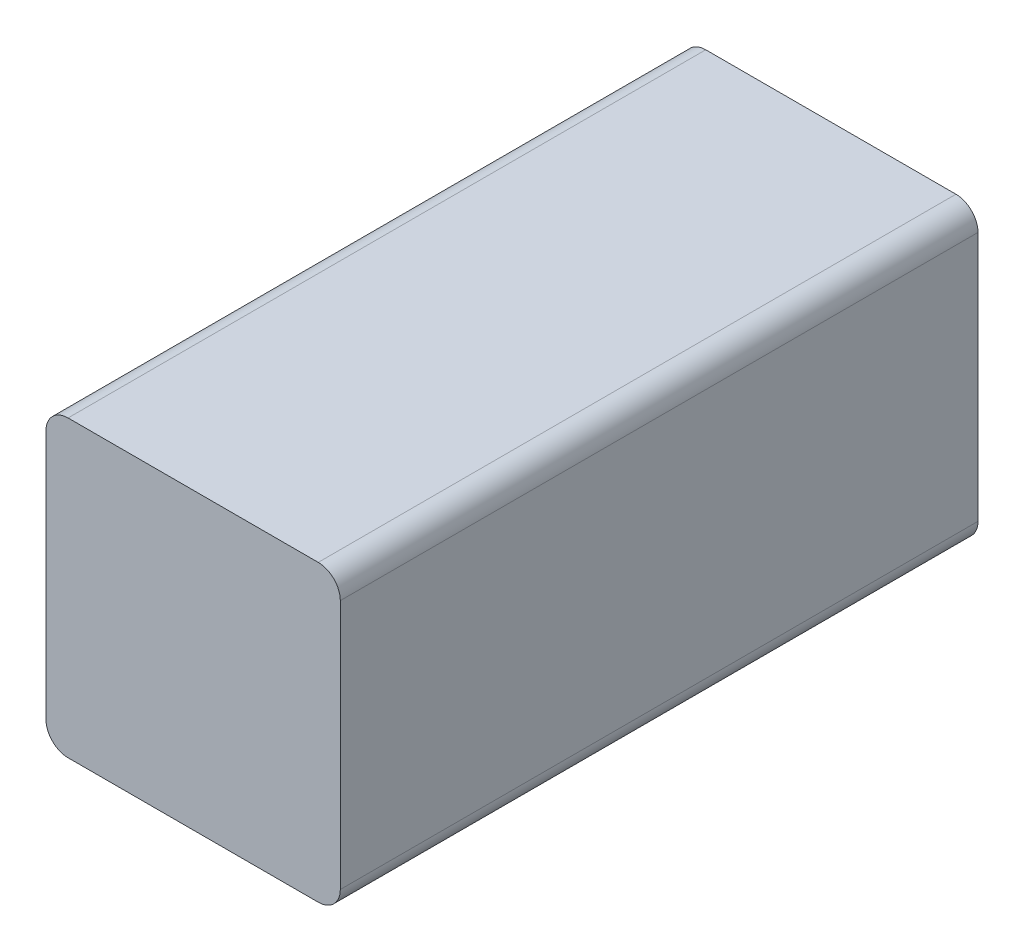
from build123d import *

# Parameters (mm, degrees)
EXTRUSION1_DEPTH = 65


with BuildPart() as part:
    # Esquisse1 → Extrusion1 (new body)
    with BuildSketch(Plane.XY):
        with BuildLine():
            Line((-15, 12.75), (-15, -12.75))
            ThreePointArc((-15, -12.75), (-14.340990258, -14.340990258), (-12.75, -15))
            Line((-12.75, -15), (12.75, -15))
            ThreePointArc((12.75, -15), (14.340990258, -14.340990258), (15, -12.75))
            Line((15, -12.75), (15, 12.75))
            ThreePointArc((15, 12.75), (14.340990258, 14.340990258), (12.75, 15))
            Line((12.75, 15), (-12.75, 15))
            ThreePointArc((-12.75, 15), (-14.340990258, 14.340990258), (-15, 12.75))
        make_face()
    extrude(amount=EXTRUSION1_DEPTH)


solid = part.part
